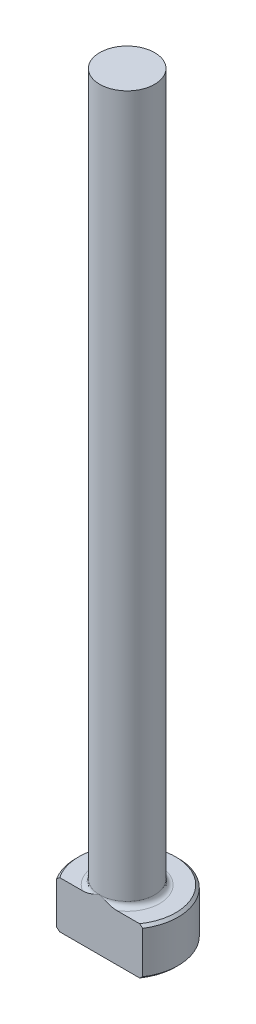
from build123d import *

# Parameters (mm, degrees)
CHAMFER1_SIZE = 0.254
FILLET1_R     = 0.508
KEY_DEPTH     = 77.548107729


with BuildPart() as part:
    # Sketch1 → Revolve1 (revolve)
    with BuildSketch(Plane.XY, mode=Mode.PRIVATE) as revolve1_sk:
        Polygon((0, 0), (-5.1562, 0), (-5.1562, 4.7498), (-2.77749, 4.7498), (-2.77749, 76.2), (0, 76.2), align=None)
    revolve(revolve1_sk.sketch.rotate(Axis((0, 259.958771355, 0), (0, -1, 0)), 270), axis=Axis((0, 259.958771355, 0), (0, -1, 0)))

    # Chamfer1
    chamfer1_edges = [part.edges().sort_by_distance(p)[0] for p in [
        (0, 4.7498, -5.1562),
        (0, 0, -5.1562),
    ]]
    chamfer(chamfer1_edges, length=CHAMFER1_SIZE)

    # Fillet1
    fillet1_edges = [part.edges().sort_by_distance(p)[0] for p in [
        (0, 4.7498, -2.77749),
    ]]
    fillet(fillet1_edges, radius=FILLET1_R)

    # Sketch2 → Key (cut, through all)
    with BuildSketch(Plane(origin=(0, 0, 0), x_dir=(1, 0, 0), z_dir=(0, 1, 0))):
        with BuildLine():
            Line((-4.344185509, -2.77749), (4.344185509, -2.77749))
            ThreePointArc((4.344185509, -2.77749), (0, -5.1562), (-4.344185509, -2.77749))
        make_face()
    extrude(amount=KEY_DEPTH, mode=Mode.SUBTRACT)


solid = part.part
